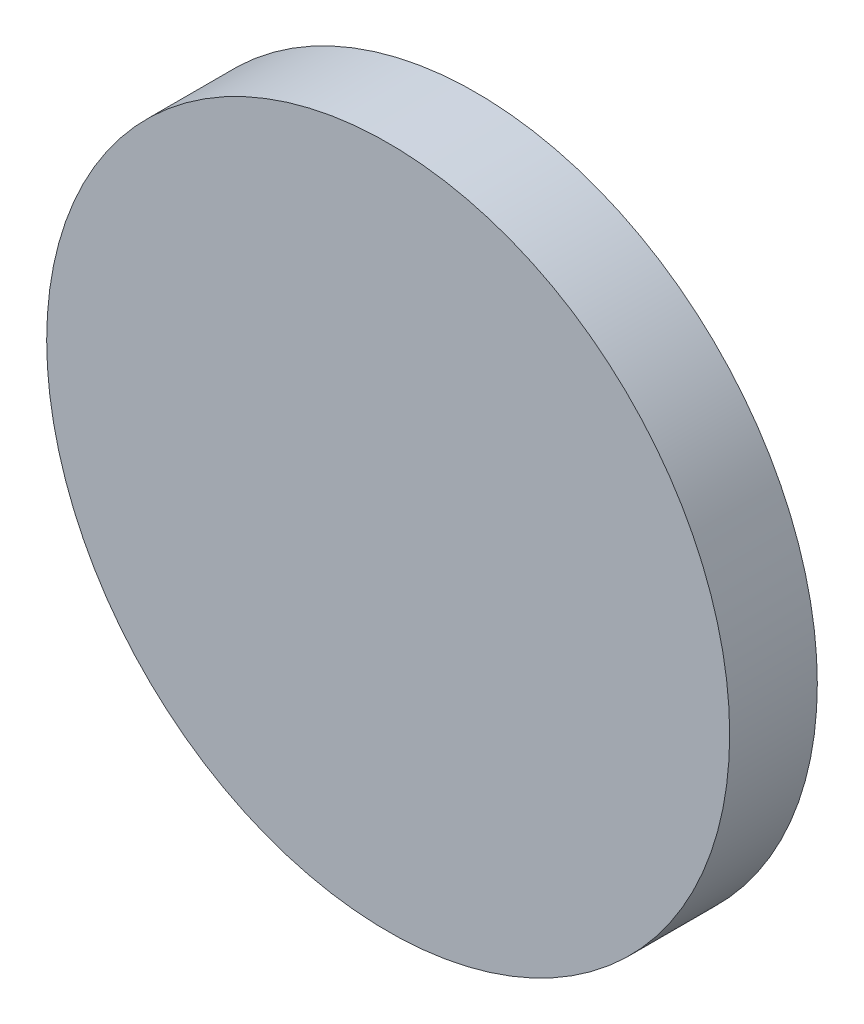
ISO-10303-21;
HEADER;
FILE_DESCRIPTION(('STEP AP214'),'2;1');
FILE_NAME('part.step','',(''),(''),'','','');
FILE_SCHEMA(('AUTOMOTIVE_DESIGN { 1 0 10303 214 1 1 1 1 }'));
ENDSEC;
DATA;
#1=APPLICATION_CONTEXT('core data for automotive mechanical design processes');
#2=APPLICATION_PROTOCOL_DEFINITION('international standard','automotive_design',2000,#1);
#3=PRODUCT_CONTEXT('',#1,'mechanical');
#4=PRODUCT('Part','Part','',(#3));
#5=PRODUCT_RELATED_PRODUCT_CATEGORY('part','',(#4));
#6=PRODUCT_DEFINITION_FORMATION('','',#4);
#7=PRODUCT_DEFINITION_CONTEXT('part definition',#1,'design');
#8=PRODUCT_DEFINITION('design','',#6,#7);
#9=PRODUCT_DEFINITION_SHAPE('','',#8);
#10=(LENGTH_UNIT() NAMED_UNIT(*) SI_UNIT(.MILLI.,.METRE.));
#11=(NAMED_UNIT(*) PLANE_ANGLE_UNIT() SI_UNIT($,.RADIAN.));
#12=(NAMED_UNIT(*) SI_UNIT($,.STERADIAN.) SOLID_ANGLE_UNIT());
#13=UNCERTAINTY_MEASURE_WITH_UNIT(LENGTH_MEASURE(1.E-05),#10,'distance_accuracy_value','');
#14=(GEOMETRIC_REPRESENTATION_CONTEXT(3) GLOBAL_UNCERTAINTY_ASSIGNED_CONTEXT((#13)) GLOBAL_UNIT_ASSIGNED_CONTEXT((#10,
#11,#12)) REPRESENTATION_CONTEXT('',''));
#15=CARTESIAN_POINT('',(0.,0.,0.));
#16=DIRECTION('',(0.,0.,1.));
#17=DIRECTION('',(1.,0.,0.));
#18=AXIS2_PLACEMENT_3D('',#15,#16,#17);
#19=CARTESIAN_POINT('',(0.,0.,2.54));
#20=DIRECTION('',(0.,0.,-1.));
#21=DIRECTION('',(-1.,0.,0.));
#22=AXIS2_PLACEMENT_3D('',#19,#20,#21);
#23=CYLINDRICAL_SURFACE('',#22,9.89741595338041);
#24=CARTESIAN_POINT('',(0.,0.,2.54));
#25=DIRECTION('',(0.,0.,1.));
#26=DIRECTION('',(1.,0.,0.));
#27=AXIS2_PLACEMENT_3D('',#24,#25,#26);
#28=CIRCLE('',#27,9.89741595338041);
#29=CARTESIAN_POINT('',(9.89741595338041,0.,2.54));
#30=VERTEX_POINT('',#29);
#31=EDGE_CURVE('E10',#30,#30,#28,.T.);
#32=ORIENTED_EDGE('',*,*,#31,.F.);
#33=EDGE_LOOP('',(#32));
#34=FACE_BOUND('',#33,.T.);
#35=CARTESIAN_POINT('',(0.,0.,0.));
#36=DIRECTION('',(0.,0.,1.));
#37=DIRECTION('',(1.,0.,0.));
#38=AXIS2_PLACEMENT_3D('',#35,#36,#37);
#39=CIRCLE('',#38,9.89741595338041);
#40=CARTESIAN_POINT('',(9.89741595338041,0.,0.));
#41=VERTEX_POINT('',#40);
#42=EDGE_CURVE('E33',#41,#41,#39,.T.);
#43=ORIENTED_EDGE('',*,*,#42,.T.);
#44=EDGE_LOOP('',(#43));
#45=FACE_BOUND('',#44,.T.);
#46=ADVANCED_FACE('F30',(#34,#45),#23,.T.);
#47=CARTESIAN_POINT('',(0.,0.,2.54));
#48=DIRECTION('',(0.,0.,1.));
#49=DIRECTION('',(1.,0.,0.));
#50=AXIS2_PLACEMENT_3D('',#47,#48,#49);
#51=PLANE('',#50);
#52=ORIENTED_EDGE('',*,*,#31,.T.);
#53=EDGE_LOOP('',(#52));
#54=FACE_BOUND('',#53,.T.);
#55=ADVANCED_FACE('F45',(#54),#51,.T.);
#56=CARTESIAN_POINT('',(0.,0.,0.));
#57=DIRECTION('',(0.,0.,1.));
#58=DIRECTION('',(1.,0.,0.));
#59=AXIS2_PLACEMENT_3D('',#56,#57,#58);
#60=PLANE('',#59);
#61=ORIENTED_EDGE('',*,*,#42,.F.);
#62=EDGE_LOOP('',(#61));
#63=FACE_BOUND('',#62,.T.);
#64=ADVANCED_FACE('F43',(#63),#60,.F.);
#65=CLOSED_SHELL('',(#46,#55,#64));
#66=MANIFOLD_SOLID_BREP('B2',#65);
#67=ADVANCED_BREP_SHAPE_REPRESENTATION('',(#18,#66),#14);
#68=SHAPE_DEFINITION_REPRESENTATION(#9,#67);
ENDSEC;
END-ISO-10303-21;
